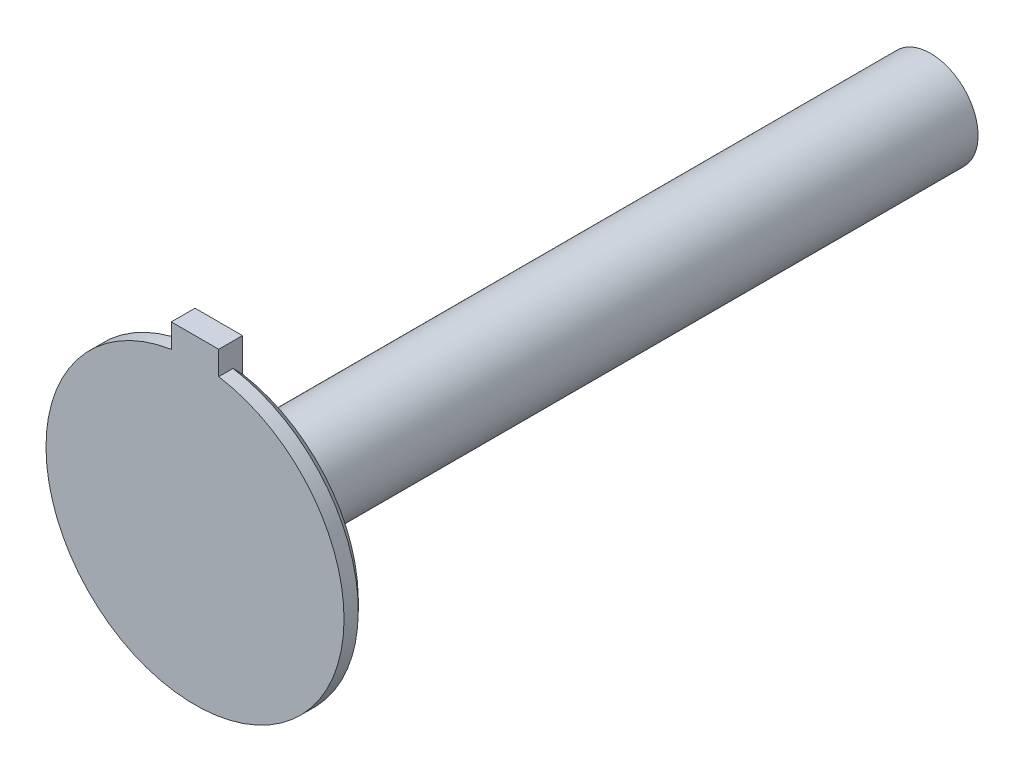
ISO-10303-21;
HEADER;
FILE_DESCRIPTION(('STEP AP214'),'2;1');
FILE_NAME('part.step','',(''),(''),'','','');
FILE_SCHEMA(('AUTOMOTIVE_DESIGN { 1 0 10303 214 1 1 1 1 }'));
ENDSEC;
DATA;
#1=APPLICATION_CONTEXT('core data for automotive mechanical design processes');
#2=APPLICATION_PROTOCOL_DEFINITION('international standard','automotive_design',2000,#1);
#3=PRODUCT_CONTEXT('',#1,'mechanical');
#4=PRODUCT('Part','Part','',(#3));
#5=PRODUCT_RELATED_PRODUCT_CATEGORY('part','',(#4));
#6=PRODUCT_DEFINITION_FORMATION('','',#4);
#7=PRODUCT_DEFINITION_CONTEXT('part definition',#1,'design');
#8=PRODUCT_DEFINITION('design','',#6,#7);
#9=PRODUCT_DEFINITION_SHAPE('','',#8);
#10=(LENGTH_UNIT() NAMED_UNIT(*) SI_UNIT(.MILLI.,.METRE.));
#11=(NAMED_UNIT(*) PLANE_ANGLE_UNIT() SI_UNIT($,.RADIAN.));
#12=(NAMED_UNIT(*) SI_UNIT($,.STERADIAN.) SOLID_ANGLE_UNIT());
#13=UNCERTAINTY_MEASURE_WITH_UNIT(LENGTH_MEASURE(1.E-05),#10,'distance_accuracy_value','');
#14=(GEOMETRIC_REPRESENTATION_CONTEXT(3) GLOBAL_UNCERTAINTY_ASSIGNED_CONTEXT((#13)) GLOBAL_UNIT_ASSIGNED_CONTEXT((#10,
#11,#12)) REPRESENTATION_CONTEXT('',''));
#15=CARTESIAN_POINT('',(0.,0.,0.));
#16=DIRECTION('',(0.,0.,1.));
#17=DIRECTION('',(1.,0.,0.));
#18=AXIS2_PLACEMENT_3D('',#15,#16,#17);
#19=CARTESIAN_POINT('',(0.,0.,0.));
#20=DIRECTION('',(0.,0.,1.));
#21=DIRECTION('',(0.999999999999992,0.,0.));
#22=AXIS2_PLACEMENT_3D('',#19,#20,#21);
#23=PLANE('',#22);
#24=DIRECTION('',(0.,1.,0.));
#25=VECTOR('',#24,1.);
#26=CARTESIAN_POINT('',(4.99999999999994,35.9993548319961,0.));
#27=LINE('',#26,#25);
#28=CARTESIAN_POINT('',(4.99999999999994,28.9717103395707,0.));
#29=VERTEX_POINT('',#28);
#30=CARTESIAN_POINT('',(4.99999999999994,35.9993548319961,0.));
#31=VERTEX_POINT('',#30);
#32=EDGE_CURVE('E54',#29,#31,#27,.T.);
#33=ORIENTED_EDGE('',*,*,#32,.F.);
#34=CARTESIAN_POINT('',(0.,0.,0.));
#35=DIRECTION('',(0.,0.,1.));
#36=DIRECTION('',(1.,0.,0.));
#37=AXIS2_PLACEMENT_3D('',#34,#35,#36);
#38=CIRCLE('',#37,29.3999999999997);
#39=CARTESIAN_POINT('',(-4.99999999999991,28.9717103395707,0.));
#40=VERTEX_POINT('',#39);
#41=EDGE_CURVE('E124',#29,#40,#38,.F.);
#42=ORIENTED_EDGE('',*,*,#41,.T.);
#43=DIRECTION('',(0.,-1.,0.));
#44=VECTOR('',#43,1.);
#45=CARTESIAN_POINT('',(-4.99999999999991,30.9993548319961,0.));
#46=LINE('',#45,#44);
#47=CARTESIAN_POINT('',(-4.99999999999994,35.9993548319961,0.));
#48=VERTEX_POINT('',#47);
#49=EDGE_CURVE('E61',#48,#40,#46,.T.);
#50=ORIENTED_EDGE('',*,*,#49,.F.);
#51=DIRECTION('',(-0.999999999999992,0.,0.));
#52=VECTOR('',#51,1.);
#53=CARTESIAN_POINT('',(-4.99999999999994,35.9993548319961,0.));
#54=LINE('',#53,#52);
#55=EDGE_CURVE('E91',#31,#48,#54,.T.);
#56=ORIENTED_EDGE('',*,*,#55,.F.);
#57=EDGE_LOOP('',(#33,#42,#50,#56));
#58=FACE_BOUND('',#57,.T.);
#59=CARTESIAN_POINT('',(0.,0.,0.));
#60=DIRECTION('',(0.,0.,-1.));
#61=DIRECTION('',(-0.999999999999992,0.,0.));
#62=AXIS2_PLACEMENT_3D('',#59,#60,#61);
#63=CIRCLE('',#62,10.);
#64=CARTESIAN_POINT('',(-9.99999999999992,0.,0.));
#65=VERTEX_POINT('',#64);
#66=EDGE_CURVE('E105',#65,#65,#63,.T.);
#67=ORIENTED_EDGE('',*,*,#66,.F.);
#68=EDGE_LOOP('',(#67));
#69=FACE_BOUND('',#68,.T.);
#70=ADVANCED_FACE('F34',(#58,#69),#23,.F.);
#71=CARTESIAN_POINT('',(0.,0.,97.1222721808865));
#72=DIRECTION('',(0.,0.,-1.));
#73=DIRECTION('',(-0.999999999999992,0.,0.));
#74=AXIS2_PLACEMENT_3D('',#71,#72,#73);
#75=CYLINDRICAL_SURFACE('',#74,31.4);
#76=DIRECTION('',(0.,0.,-1.));
#77=VECTOR('',#76,1.);
#78=CARTESIAN_POINT('',(-4.99999999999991,30.9993548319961,97.1222721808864));
#79=LINE('',#78,#77);
#80=CARTESIAN_POINT('',(-4.99999999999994,30.9993548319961,5.00000000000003));
#81=VERTEX_POINT('',#80);
#82=CARTESIAN_POINT('',(-4.99999999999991,30.9993548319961,2.00000000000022));
#83=VERTEX_POINT('',#82);
#84=EDGE_CURVE('E97',#81,#83,#79,.T.);
#85=ORIENTED_EDGE('',*,*,#84,.T.);
#86=CARTESIAN_POINT('',(0.,0.,2.00000000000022));
#87=DIRECTION('',(0.,0.,1.));
#88=DIRECTION('',(1.,0.,0.));
#89=AXIS2_PLACEMENT_3D('',#86,#87,#88);
#90=CIRCLE('',#89,31.4);
#91=CARTESIAN_POINT('',(4.99999999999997,30.9993548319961,2.00000000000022));
#92=VERTEX_POINT('',#91);
#93=EDGE_CURVE('E108',#83,#92,#90,.T.);
#94=ORIENTED_EDGE('',*,*,#93,.T.);
#95=DIRECTION('',(0.,0.,-1.));
#96=VECTOR('',#95,1.);
#97=CARTESIAN_POINT('',(4.99999999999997,30.9993548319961,97.1222721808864));
#98=LINE('',#97,#96);
#99=CARTESIAN_POINT('',(4.99999999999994,30.9993548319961,5.));
#100=VERTEX_POINT('',#99);
#101=EDGE_CURVE('E115',#100,#92,#98,.T.);
#102=ORIENTED_EDGE('',*,*,#101,.F.);
#103=CARTESIAN_POINT('',(0.,0.,5.));
#104=DIRECTION('',(0.,0.,1.));
#105=DIRECTION('',(0.999999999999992,0.,0.));
#106=AXIS2_PLACEMENT_3D('',#103,#104,#105);
#107=CIRCLE('',#106,31.4);
#108=EDGE_CURVE('E101',#81,#100,#107,.T.);
#109=ORIENTED_EDGE('',*,*,#108,.F.);
#110=EDGE_LOOP('',(#85,#94,#102,#109));
#111=FACE_BOUND('',#110,.T.);
#112=ADVANCED_FACE('F147',(#111),#75,.T.);
#113=CARTESIAN_POINT('',(4.99999999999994,35.9993548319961,97.1222721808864));
#114=DIRECTION('',(-0.999999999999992,0.,0.));
#115=DIRECTION('',(0.,0.,1.));
#116=AXIS2_PLACEMENT_3D('',#113,#114,#115);
#117=PLANE('',#116);
#118=DIRECTION('',(0.,1.,0.));
#119=VECTOR('',#118,1.);
#120=CARTESIAN_POINT('',(4.99999999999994,35.9993548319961,5.));
#121=LINE('',#120,#119);
#122=CARTESIAN_POINT('',(4.99999999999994,35.9993548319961,5.));
#123=VERTEX_POINT('',#122);
#124=EDGE_CURVE('E104',#100,#123,#121,.T.);
#125=ORIENTED_EDGE('',*,*,#124,.F.);
#126=ORIENTED_EDGE('',*,*,#101,.T.);
#127=CARTESIAN_POINT('',(4.99999999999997,30.9993548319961,2.00000000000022));
#128=CARTESIAN_POINT('',(4.99999999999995,30.6615666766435,1.66651196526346));
#129=CARTESIAN_POINT('',(4.99999999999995,30.3237022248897,1.33310128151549));
#130=CARTESIAN_POINT('',(4.99999999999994,29.6478207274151,0.666434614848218));
#131=CARTESIAN_POINT('',(4.99999999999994,29.3098036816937,0.333178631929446));
#132=CARTESIAN_POINT('',(4.99999999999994,28.9717103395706,0.));
#133=B_SPLINE_CURVE_WITH_KNOTS('',3,(#127,#128,#129,#130,#131,#132),.UNSPECIFIED.,.F.,.F.,(4,2,
4),(0.,1.42402094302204,2.84804189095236),.UNSPECIFIED.);
#134=EDGE_CURVE('E47',#92,#29,#133,.T.);
#135=ORIENTED_EDGE('',*,*,#134,.T.);
#136=ORIENTED_EDGE('',*,*,#32,.T.);
#137=DIRECTION('',(0.,0.,-1.));
#138=VECTOR('',#137,1.);
#139=CARTESIAN_POINT('',(4.99999999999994,35.9993548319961,97.1222721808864));
#140=LINE('',#139,#138);
#141=EDGE_CURVE('E118',#123,#31,#140,.T.);
#142=ORIENTED_EDGE('',*,*,#141,.F.);
#143=EDGE_LOOP('',(#125,#126,#135,#136,#142));
#144=FACE_BOUND('',#143,.T.);
#145=ADVANCED_FACE('F129',(#144),#117,.F.);
#146=CARTESIAN_POINT('',(-4.99999999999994,35.9993548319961,97.1222721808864));
#147=DIRECTION('',(0.,-1.,0.));
#148=DIRECTION('',(0.,0.,-1.));
#149=AXIS2_PLACEMENT_3D('',#146,#147,#148);
#150=PLANE('',#149);
#151=DIRECTION('',(-0.999999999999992,0.,0.));
#152=VECTOR('',#151,1.);
#153=CARTESIAN_POINT('',(-4.99999999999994,35.9993548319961,5.));
#154=LINE('',#153,#152);
#155=CARTESIAN_POINT('',(-4.99999999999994,35.9993548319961,5.));
#156=VERTEX_POINT('',#155);
#157=EDGE_CURVE('E89',#123,#156,#154,.T.);
#158=ORIENTED_EDGE('',*,*,#157,.F.);
#159=ORIENTED_EDGE('',*,*,#141,.T.);
#160=ORIENTED_EDGE('',*,*,#55,.T.);
#161=DIRECTION('',(0.,0.,-1.));
#162=VECTOR('',#161,1.);
#163=CARTESIAN_POINT('',(-4.99999999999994,35.9993548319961,97.1222721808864));
#164=LINE('',#163,#162);
#165=EDGE_CURVE('E85',#156,#48,#164,.T.);
#166=ORIENTED_EDGE('',*,*,#165,.F.);
#167=EDGE_LOOP('',(#158,#159,#160,#166));
#168=FACE_BOUND('',#167,.T.);
#169=ADVANCED_FACE('F87',(#168),#150,.F.);
#170=CARTESIAN_POINT('',(-4.99999999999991,30.9993548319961,97.1222721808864));
#171=DIRECTION('',(0.999999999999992,0.,0.));
#172=DIRECTION('',(0.,0.,-1.));
#173=AXIS2_PLACEMENT_3D('',#170,#171,#172);
#174=PLANE('',#173);
#175=DIRECTION('',(0.,-1.,0.));
#176=VECTOR('',#175,1.);
#177=CARTESIAN_POINT('',(-4.99999999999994,30.9993548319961,5.00000000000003));
#178=LINE('',#177,#176);
#179=EDGE_CURVE('E94',#156,#81,#178,.T.);
#180=ORIENTED_EDGE('',*,*,#179,.F.);
#181=ORIENTED_EDGE('',*,*,#165,.T.);
#182=ORIENTED_EDGE('',*,*,#49,.T.);
#183=CARTESIAN_POINT('',(-4.99999999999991,28.9717103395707,0.));
#184=CARTESIAN_POINT('',(-4.99999999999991,29.3098036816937,0.333178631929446));
#185=CARTESIAN_POINT('',(-4.99999999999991,29.6478207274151,0.666434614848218));
#186=CARTESIAN_POINT('',(-4.99999999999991,30.3237022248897,1.33310128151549));
#187=CARTESIAN_POINT('',(-4.99999999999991,30.6615666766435,1.66651196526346));
#188=CARTESIAN_POINT('',(-4.99999999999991,30.9993548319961,2.00000000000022));
#189=B_SPLINE_CURVE_WITH_KNOTS('',3,(#183,#184,#185,#186,#187,#188),.UNSPECIFIED.,.F.,.F.,(4,2,
4),(0.,1.42402094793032,2.84804189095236),.UNSPECIFIED.);
#190=EDGE_CURVE('E11',#40,#83,#189,.T.);
#191=ORIENTED_EDGE('',*,*,#190,.T.);
#192=ORIENTED_EDGE('',*,*,#84,.F.);
#193=EDGE_LOOP('',(#180,#181,#182,#191,#192));
#194=FACE_BOUND('',#193,.T.);
#195=ADVANCED_FACE('F95',(#194),#174,.F.);
#196=CARTESIAN_POINT('',(0.,33.4,5.));
#197=DIRECTION('',(0.,0.,1.));
#198=DIRECTION('',(0.999999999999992,0.,0.));
#199=AXIS2_PLACEMENT_3D('',#196,#197,#198);
#200=PLANE('',#199);
#201=ORIENTED_EDGE('',*,*,#179,.T.);
#202=ORIENTED_EDGE('',*,*,#108,.T.);
#203=ORIENTED_EDGE('',*,*,#124,.T.);
#204=ORIENTED_EDGE('',*,*,#157,.T.);
#205=EDGE_LOOP('',(#201,#202,#203,#204));
#206=FACE_BOUND('',#205,.T.);
#207=ADVANCED_FACE('F36',(#206),#200,.T.);
#208=CARTESIAN_POINT('',(0.,0.,-150.));
#209=DIRECTION('',(0.,0.,1.));
#210=DIRECTION('',(0.999999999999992,0.,0.));
#211=AXIS2_PLACEMENT_3D('',#208,#209,#210);
#212=CYLINDRICAL_SURFACE('',#211,10.);
#213=CARTESIAN_POINT('',(0.,0.,-150.));
#214=DIRECTION('',(0.,0.,-1.));
#215=DIRECTION('',(-0.999999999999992,0.,0.));
#216=AXIS2_PLACEMENT_3D('',#213,#214,#215);
#217=CIRCLE('',#216,10.);
#218=CARTESIAN_POINT('',(-9.99999999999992,0.,-150.));
#219=VERTEX_POINT('',#218);
#220=EDGE_CURVE('E121',#219,#219,#217,.T.);
#221=ORIENTED_EDGE('',*,*,#220,.F.);
#222=EDGE_LOOP('',(#221));
#223=FACE_BOUND('',#222,.T.);
#224=ORIENTED_EDGE('',*,*,#66,.T.);
#225=EDGE_LOOP('',(#224));
#226=FACE_BOUND('',#225,.T.);
#227=ADVANCED_FACE('F141',(#223,#226),#212,.T.);
#228=CARTESIAN_POINT('',(0.,0.,-150.));
#229=DIRECTION('',(0.,0.,-1.));
#230=DIRECTION('',(-0.999999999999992,0.,0.));
#231=AXIS2_PLACEMENT_3D('',#228,#229,#230);
#232=PLANE('',#231);
#233=ORIENTED_EDGE('',*,*,#220,.T.);
#234=EDGE_LOOP('',(#233));
#235=FACE_BOUND('',#234,.T.);
#236=ADVANCED_FACE('F136',(#235),#232,.T.);
#237=CARTESIAN_POINT('',(0.,0.,2.00000000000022));
#238=DIRECTION('',(0.,0.,1.));
#239=DIRECTION('',(1.,0.,0.));
#240=AXIS2_PLACEMENT_3D('',#237,#238,#239);
#241=CONICAL_SURFACE('',#240,31.4,0.785398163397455);
#242=ORIENTED_EDGE('',*,*,#190,.F.);
#243=ORIENTED_EDGE('',*,*,#41,.F.);
#244=ORIENTED_EDGE('',*,*,#134,.F.);
#245=ORIENTED_EDGE('',*,*,#93,.F.);
#246=EDGE_LOOP('',(#242,#243,#244,#245));
#247=FACE_BOUND('',#246,.T.);
#248=ADVANCED_FACE('F132',(#247),#241,.T.);
#249=CLOSED_SHELL('',(#70,#112,#145,#169,#195,#207,#227,#236,#248));
#250=MANIFOLD_SOLID_BREP('B2',#249);
#251=ADVANCED_BREP_SHAPE_REPRESENTATION('',(#18,#250),#14);
#252=SHAPE_DEFINITION_REPRESENTATION(#9,#251);
ENDSEC;
END-ISO-10303-21;
